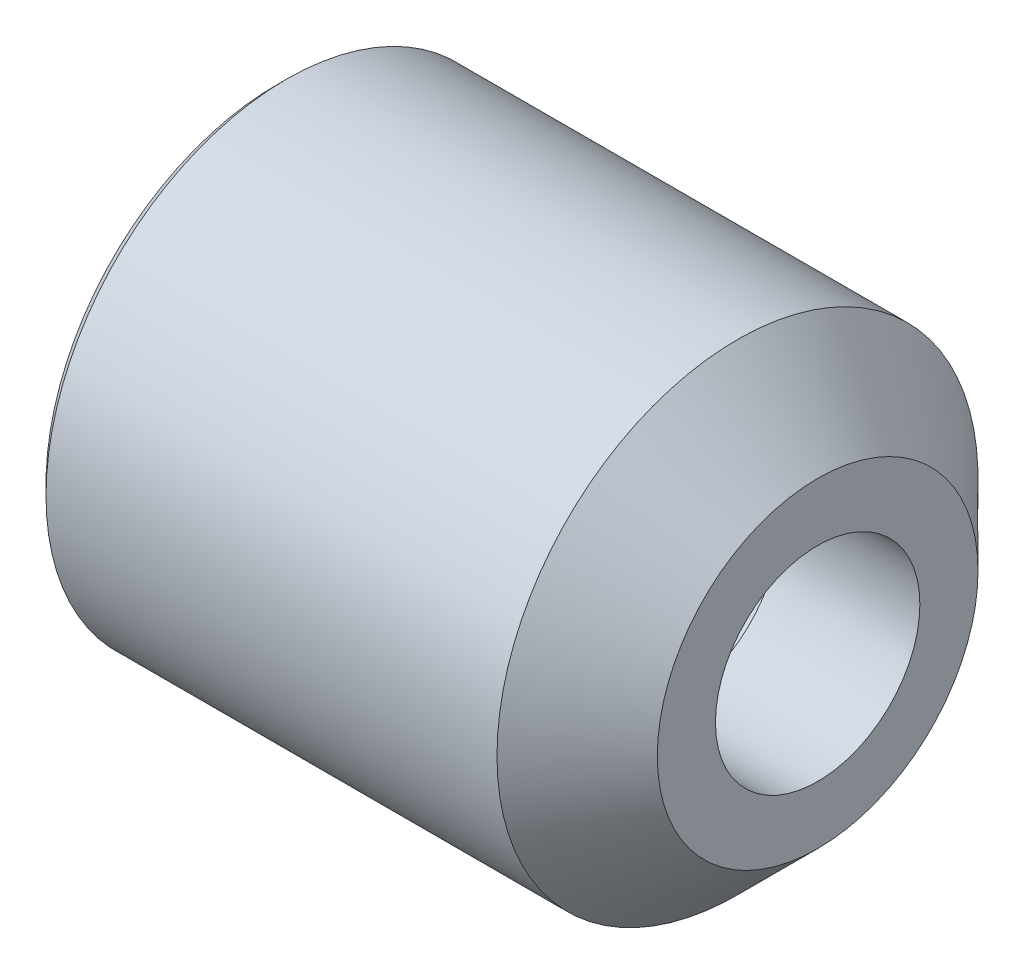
ISO-10303-21;
HEADER;
FILE_DESCRIPTION(('STEP AP214'),'2;1');
FILE_NAME('part.step','',(''),(''),'','','');
FILE_SCHEMA(('AUTOMOTIVE_DESIGN { 1 0 10303 214 1 1 1 1 }'));
ENDSEC;
DATA;
#1=APPLICATION_CONTEXT('core data for automotive mechanical design processes');
#2=APPLICATION_PROTOCOL_DEFINITION('international standard','automotive_design',2000,#1);
#3=PRODUCT_CONTEXT('',#1,'mechanical');
#4=PRODUCT('Part','Part','',(#3));
#5=PRODUCT_RELATED_PRODUCT_CATEGORY('part','',(#4));
#6=PRODUCT_DEFINITION_FORMATION('','',#4);
#7=PRODUCT_DEFINITION_CONTEXT('part definition',#1,'design');
#8=PRODUCT_DEFINITION('design','',#6,#7);
#9=PRODUCT_DEFINITION_SHAPE('','',#8);
#10=(LENGTH_UNIT() NAMED_UNIT(*) SI_UNIT(.MILLI.,.METRE.));
#11=(NAMED_UNIT(*) PLANE_ANGLE_UNIT() SI_UNIT($,.RADIAN.));
#12=(NAMED_UNIT(*) SI_UNIT($,.STERADIAN.) SOLID_ANGLE_UNIT());
#13=UNCERTAINTY_MEASURE_WITH_UNIT(LENGTH_MEASURE(1.E-05),#10,'distance_accuracy_value','');
#14=(GEOMETRIC_REPRESENTATION_CONTEXT(3) GLOBAL_UNCERTAINTY_ASSIGNED_CONTEXT((#13)) GLOBAL_UNIT_ASSIGNED_CONTEXT((#10,
#11,#12)) REPRESENTATION_CONTEXT('',''));
#15=CARTESIAN_POINT('',(0.,0.,0.));
#16=DIRECTION('',(0.,0.,1.));
#17=DIRECTION('',(1.,0.,0.));
#18=AXIS2_PLACEMENT_3D('',#15,#16,#17);
#19=CARTESIAN_POINT('',(0.,12.,0.));
#20=DIRECTION('',(1.,0.,0.));
#21=DIRECTION('',(0.,0.,-1.));
#22=AXIS2_PLACEMENT_3D('',#19,#20,#21);
#23=PLANE('',#22);
#24=CARTESIAN_POINT('',(0.,0.,0.));
#25=DIRECTION('',(1.,0.,0.));
#26=DIRECTION('',(0.,0.,-1.));
#27=AXIS2_PLACEMENT_3D('',#24,#25,#26);
#28=CIRCLE('',#27,11.5);
#29=CARTESIAN_POINT('',(0.,0.,-11.5));
#30=VERTEX_POINT('',#29);
#31=EDGE_CURVE('E39',#30,#30,#28,.F.);
#32=ORIENTED_EDGE('',*,*,#31,.T.);
#33=EDGE_LOOP('',(#32));
#34=FACE_BOUND('',#33,.T.);
#35=CARTESIAN_POINT('',(0.,0.,0.));
#36=DIRECTION('',(-1.,0.,0.));
#37=DIRECTION('',(0.,0.,1.));
#38=AXIS2_PLACEMENT_3D('',#35,#36,#37);
#39=CIRCLE('',#38,8.6);
#40=CARTESIAN_POINT('',(0.,0.,8.6));
#41=VERTEX_POINT('',#40);
#42=EDGE_CURVE('E52',#41,#41,#39,.T.);
#43=ORIENTED_EDGE('',*,*,#42,.F.);
#44=EDGE_LOOP('',(#43));
#45=FACE_BOUND('',#44,.T.);
#46=ADVANCED_FACE('F32',(#34,#45),#23,.F.);
#47=CARTESIAN_POINT('',(-60.9367402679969,0.,0.));
#48=DIRECTION('',(-1.,0.,0.));
#49=DIRECTION('',(0.,0.,1.));
#50=AXIS2_PLACEMENT_3D('',#47,#48,#49);
#51=CYLINDRICAL_SURFACE('',#50,8.6);
#52=CARTESIAN_POINT('',(20.,0.,0.));
#53=DIRECTION('',(-1.,0.,0.));
#54=DIRECTION('',(0.,0.,1.));
#55=AXIS2_PLACEMENT_3D('',#52,#53,#54);
#56=CIRCLE('',#55,8.6);
#57=CARTESIAN_POINT('',(20.,0.,8.6));
#58=VERTEX_POINT('',#57);
#59=EDGE_CURVE('E55',#58,#58,#56,.T.);
#60=ORIENTED_EDGE('',*,*,#59,.F.);
#61=EDGE_LOOP('',(#60));
#62=FACE_BOUND('',#61,.T.);
#63=ORIENTED_EDGE('',*,*,#42,.T.);
#64=EDGE_LOOP('',(#63));
#65=FACE_BOUND('',#64,.T.);
#66=ADVANCED_FACE('F76',(#62,#65),#51,.F.);
#67=CARTESIAN_POINT('',(20.,8.6,0.));
#68=DIRECTION('',(1.,0.,0.));
#69=DIRECTION('',(0.,0.,-1.));
#70=AXIS2_PLACEMENT_3D('',#67,#68,#69);
#71=PLANE('',#70);
#72=CARTESIAN_POINT('',(20.,0.,0.));
#73=DIRECTION('',(-1.,0.,0.));
#74=DIRECTION('',(0.,0.,1.));
#75=AXIS2_PLACEMENT_3D('',#72,#73,#74);
#76=CIRCLE('',#75,5.1);
#77=CARTESIAN_POINT('',(20.,0.,5.1));
#78=VERTEX_POINT('',#77);
#79=EDGE_CURVE('E58',#78,#78,#76,.T.);
#80=ORIENTED_EDGE('',*,*,#79,.F.);
#81=EDGE_LOOP('',(#80));
#82=FACE_BOUND('',#81,.T.);
#83=ORIENTED_EDGE('',*,*,#59,.T.);
#84=EDGE_LOOP('',(#83));
#85=FACE_BOUND('',#84,.T.);
#86=ADVANCED_FACE('F70',(#82,#85),#71,.F.);
#87=CARTESIAN_POINT('',(-60.9367402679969,0.,0.));
#88=DIRECTION('',(-1.,0.,0.));
#89=DIRECTION('',(0.,0.,1.));
#90=AXIS2_PLACEMENT_3D('',#87,#88,#89);
#91=CYLINDRICAL_SURFACE('',#90,5.1);
#92=CARTESIAN_POINT('',(27.,0.,0.));
#93=DIRECTION('',(-1.,0.,0.));
#94=DIRECTION('',(0.,0.,1.));
#95=AXIS2_PLACEMENT_3D('',#92,#93,#94);
#96=CIRCLE('',#95,5.1);
#97=CARTESIAN_POINT('',(27.,0.,5.1));
#98=VERTEX_POINT('',#97);
#99=EDGE_CURVE('E61',#98,#98,#96,.T.);
#100=ORIENTED_EDGE('',*,*,#99,.F.);
#101=EDGE_LOOP('',(#100));
#102=FACE_BOUND('',#101,.T.);
#103=ORIENTED_EDGE('',*,*,#79,.T.);
#104=EDGE_LOOP('',(#103));
#105=FACE_BOUND('',#104,.T.);
#106=ADVANCED_FACE('F67',(#102,#105),#91,.F.);
#107=CARTESIAN_POINT('',(27.,12.,0.));
#108=DIRECTION('',(-1.,0.,0.));
#109=DIRECTION('',(0.,0.,1.));
#110=AXIS2_PLACEMENT_3D('',#107,#108,#109);
#111=PLANE('',#110);
#112=CARTESIAN_POINT('',(27.,0.,0.));
#113=DIRECTION('',(-1.,0.,0.));
#114=DIRECTION('',(0.,0.,1.));
#115=AXIS2_PLACEMENT_3D('',#112,#113,#114);
#116=CIRCLE('',#115,7.99999999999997);
#117=CARTESIAN_POINT('',(27.,0.,7.99999999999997));
#118=VERTEX_POINT('',#117);
#119=EDGE_CURVE('E43',#118,#118,#116,.F.);
#120=ORIENTED_EDGE('',*,*,#119,.T.);
#121=EDGE_LOOP('',(#120));
#122=FACE_BOUND('',#121,.T.);
#123=ORIENTED_EDGE('',*,*,#99,.T.);
#124=EDGE_LOOP('',(#123));
#125=FACE_BOUND('',#124,.T.);
#126=ADVANCED_FACE('F65',(#122,#125),#111,.F.);
#127=CARTESIAN_POINT('',(-60.9367402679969,0.,0.));
#128=DIRECTION('',(-1.,0.,0.));
#129=DIRECTION('',(0.,0.,1.));
#130=AXIS2_PLACEMENT_3D('',#127,#128,#129);
#131=CYLINDRICAL_SURFACE('',#130,12.);
#132=CARTESIAN_POINT('',(0.500000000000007,0.,0.));
#133=DIRECTION('',(1.,0.,0.));
#134=DIRECTION('',(0.,0.,-1.));
#135=AXIS2_PLACEMENT_3D('',#132,#133,#134);
#136=CIRCLE('',#135,12.);
#137=CARTESIAN_POINT('',(0.500000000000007,0.,-12.));
#138=VERTEX_POINT('',#137);
#139=EDGE_CURVE('E10',#138,#138,#136,.T.);
#140=ORIENTED_EDGE('',*,*,#139,.T.);
#141=EDGE_LOOP('',(#140));
#142=FACE_BOUND('',#141,.T.);
#143=CARTESIAN_POINT('',(23.,0.,0.));
#144=DIRECTION('',(-1.,0.,0.));
#145=DIRECTION('',(0.,0.,1.));
#146=AXIS2_PLACEMENT_3D('',#143,#144,#145);
#147=CIRCLE('',#146,12.);
#148=CARTESIAN_POINT('',(23.,0.,12.));
#149=VERTEX_POINT('',#148);
#150=EDGE_CURVE('E47',#149,#149,#147,.T.);
#151=ORIENTED_EDGE('',*,*,#150,.T.);
#152=EDGE_LOOP('',(#151));
#153=FACE_BOUND('',#152,.T.);
#154=ADVANCED_FACE('F91',(#142,#153),#131,.T.);
#155=CARTESIAN_POINT('',(23.,0.,0.));
#156=DIRECTION('',(-1.,0.,0.));
#157=DIRECTION('',(0.,0.,1.));
#158=AXIS2_PLACEMENT_3D('',#155,#156,#157);
#159=CONICAL_SURFACE('',#158,12.,0.785398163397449);
#160=ORIENTED_EDGE('',*,*,#119,.F.);
#161=EDGE_LOOP('',(#160));
#162=FACE_BOUND('',#161,.T.);
#163=ORIENTED_EDGE('',*,*,#150,.F.);
#164=EDGE_LOOP('',(#163));
#165=FACE_BOUND('',#164,.T.);
#166=ADVANCED_FACE('F89',(#162,#165),#159,.T.);
#167=CARTESIAN_POINT('',(0.,0.,0.));
#168=DIRECTION('',(1.,0.,0.));
#169=DIRECTION('',(0.,0.,-1.));
#170=AXIS2_PLACEMENT_3D('',#167,#168,#169);
#171=CONICAL_SURFACE('',#170,11.5,0.78539816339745);
#172=ORIENTED_EDGE('',*,*,#139,.F.);
#173=EDGE_LOOP('',(#172));
#174=FACE_BOUND('',#173,.T.);
#175=ORIENTED_EDGE('',*,*,#31,.F.);
#176=EDGE_LOOP('',(#175));
#177=FACE_BOUND('',#176,.T.);
#178=ADVANCED_FACE('F34',(#174,#177),#171,.T.);
#179=CLOSED_SHELL('',(#46,#66,#86,#106,#126,#154,#166,#178));
#180=MANIFOLD_SOLID_BREP('B2',#179);
#181=ADVANCED_BREP_SHAPE_REPRESENTATION('',(#18,#180),#14);
#182=SHAPE_DEFINITION_REPRESENTATION(#9,#181);
ENDSEC;
END-ISO-10303-21;
